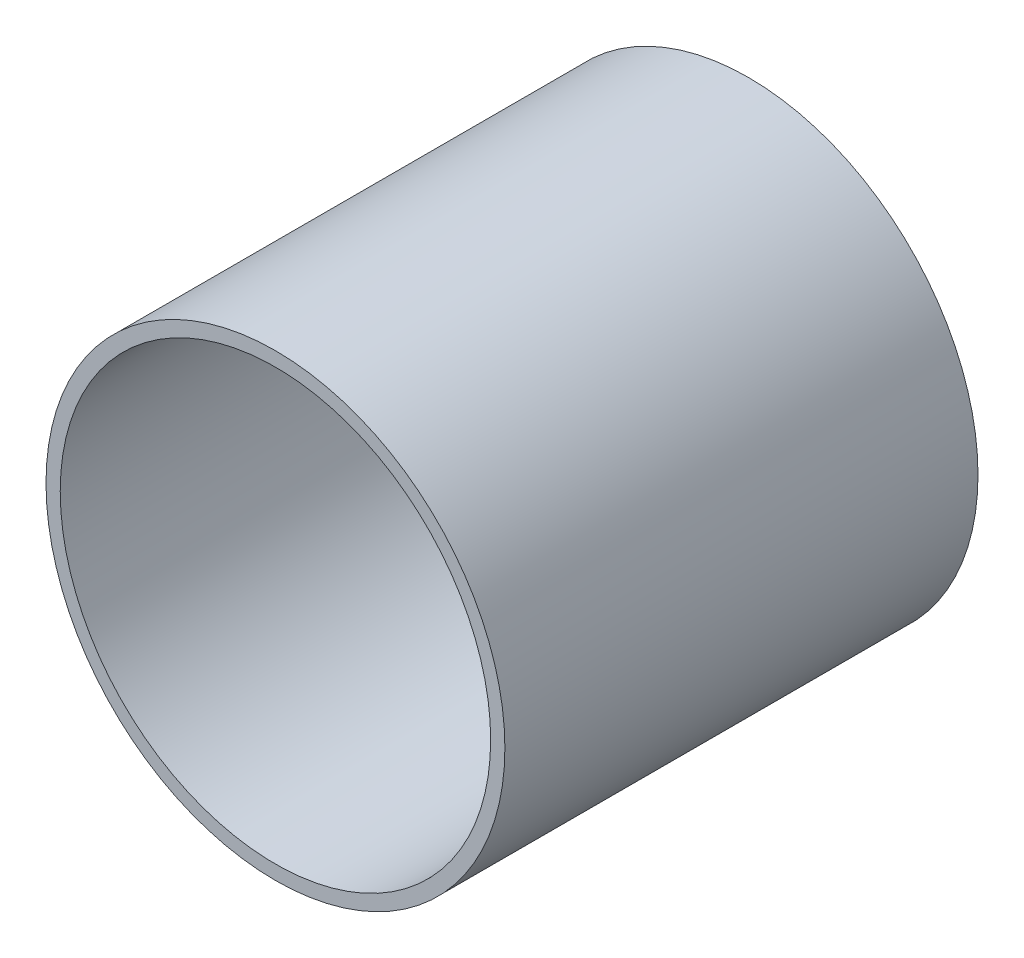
ISO-10303-21;
HEADER;
FILE_DESCRIPTION(('STEP AP214'),'2;1');
FILE_NAME('part.step','',(''),(''),'','','');
FILE_SCHEMA(('AUTOMOTIVE_DESIGN { 1 0 10303 214 1 1 1 1 }'));
ENDSEC;
DATA;
#1=APPLICATION_CONTEXT('core data for automotive mechanical design processes');
#2=APPLICATION_PROTOCOL_DEFINITION('international standard','automotive_design',2000,#1);
#3=PRODUCT_CONTEXT('',#1,'mechanical');
#4=PRODUCT('Part','Part','',(#3));
#5=PRODUCT_RELATED_PRODUCT_CATEGORY('part','',(#4));
#6=PRODUCT_DEFINITION_FORMATION('','',#4);
#7=PRODUCT_DEFINITION_CONTEXT('part definition',#1,'design');
#8=PRODUCT_DEFINITION('design','',#6,#7);
#9=PRODUCT_DEFINITION_SHAPE('','',#8);
#10=(LENGTH_UNIT() NAMED_UNIT(*) SI_UNIT(.MILLI.,.METRE.));
#11=(NAMED_UNIT(*) PLANE_ANGLE_UNIT() SI_UNIT($,.RADIAN.));
#12=(NAMED_UNIT(*) SI_UNIT($,.STERADIAN.) SOLID_ANGLE_UNIT());
#13=UNCERTAINTY_MEASURE_WITH_UNIT(LENGTH_MEASURE(1.E-05),#10,'distance_accuracy_value','');
#14=(GEOMETRIC_REPRESENTATION_CONTEXT(3) GLOBAL_UNCERTAINTY_ASSIGNED_CONTEXT((#13)) GLOBAL_UNIT_ASSIGNED_CONTEXT((#10,
#11,#12)) REPRESENTATION_CONTEXT('',''));
#15=CARTESIAN_POINT('',(0.,0.,0.));
#16=DIRECTION('',(0.,0.,1.));
#17=DIRECTION('',(1.,0.,0.));
#18=AXIS2_PLACEMENT_3D('',#15,#16,#17);
#19=CARTESIAN_POINT('',(0.,0.,1.5748));
#20=DIRECTION('',(0.,0.,-1.));
#21=DIRECTION('',(-1.,0.,0.));
#22=AXIS2_PLACEMENT_3D('',#19,#20,#21);
#23=CYLINDRICAL_SURFACE('',#22,25.4);
#24=CARTESIAN_POINT('',(0.,0.,0.));
#25=DIRECTION('',(0.,0.,1.));
#26=DIRECTION('',(1.,0.,0.));
#27=AXIS2_PLACEMENT_3D('',#24,#25,#26);
#28=CIRCLE('',#27,25.4);
#29=CARTESIAN_POINT('',(25.4,0.,0.));
#30=VERTEX_POINT('',#29);
#31=EDGE_CURVE('E46',#30,#30,#28,.T.);
#32=ORIENTED_EDGE('',*,*,#31,.T.);
#33=EDGE_LOOP('',(#32));
#34=FACE_BOUND('',#33,.T.);
#35=CARTESIAN_POINT('',(0.,0.,52.3748));
#36=DIRECTION('',(0.,0.,1.));
#37=DIRECTION('',(1.,0.,0.));
#38=AXIS2_PLACEMENT_3D('',#35,#36,#37);
#39=CIRCLE('',#38,25.4);
#40=CARTESIAN_POINT('',(25.4,0.,52.3748));
#41=VERTEX_POINT('',#40);
#42=EDGE_CURVE('E52',#41,#41,#39,.T.);
#43=ORIENTED_EDGE('',*,*,#42,.F.);
#44=EDGE_LOOP('',(#43));
#45=FACE_BOUND('',#44,.T.);
#46=ADVANCED_FACE('F39',(#34,#45),#23,.T.);
#47=CARTESIAN_POINT('',(0.,0.,0.));
#48=DIRECTION('',(0.,0.,1.));
#49=DIRECTION('',(1.,0.,0.));
#50=AXIS2_PLACEMENT_3D('',#47,#48,#49);
#51=PLANE('',#50);
#52=ORIENTED_EDGE('',*,*,#31,.F.);
#53=EDGE_LOOP('',(#52));
#54=FACE_BOUND('',#53,.T.);
#55=ADVANCED_FACE('F70',(#54),#51,.F.);
#56=CARTESIAN_POINT('',(0.,0.,52.3748));
#57=DIRECTION('',(0.,0.,1.));
#58=DIRECTION('',(1.,0.,0.));
#59=AXIS2_PLACEMENT_3D('',#56,#57,#58);
#60=PLANE('',#59);
#61=ORIENTED_EDGE('',*,*,#42,.T.);
#62=EDGE_LOOP('',(#61));
#63=FACE_BOUND('',#62,.T.);
#64=CARTESIAN_POINT('',(0.,0.,52.3748));
#65=DIRECTION('',(0.,0.,1.));
#66=DIRECTION('',(1.,0.,0.));
#67=AXIS2_PLACEMENT_3D('',#64,#65,#66);
#68=CIRCLE('',#67,23.8252);
#69=CARTESIAN_POINT('',(23.8252,0.,52.3748));
#70=VERTEX_POINT('',#69);
#71=EDGE_CURVE('E58',#70,#70,#68,.T.);
#72=ORIENTED_EDGE('',*,*,#71,.F.);
#73=EDGE_LOOP('',(#72));
#74=FACE_BOUND('',#73,.T.);
#75=ADVANCED_FACE('F68',(#63,#74),#60,.T.);
#76=CARTESIAN_POINT('',(0.,0.,52.3748));
#77=DIRECTION('',(0.,0.,-1.));
#78=DIRECTION('',(-1.,0.,0.));
#79=AXIS2_PLACEMENT_3D('',#76,#77,#78);
#80=CYLINDRICAL_SURFACE('',#79,23.8252);
#81=ORIENTED_EDGE('',*,*,#71,.T.);
#82=EDGE_LOOP('',(#81));
#83=FACE_BOUND('',#82,.T.);
#84=CARTESIAN_POINT('',(0.,0.,1.5748));
#85=DIRECTION('',(0.,0.,1.));
#86=DIRECTION('',(1.,0.,0.));
#87=AXIS2_PLACEMENT_3D('',#84,#85,#86);
#88=CIRCLE('',#87,23.8252);
#89=CARTESIAN_POINT('',(23.8252,0.,1.5748));
#90=VERTEX_POINT('',#89);
#91=EDGE_CURVE('E10',#90,#90,#88,.F.);
#92=ORIENTED_EDGE('',*,*,#91,.T.);
#93=EDGE_LOOP('',(#92));
#94=FACE_BOUND('',#93,.T.);
#95=ADVANCED_FACE('F66',(#83,#94),#80,.F.);
#96=CARTESIAN_POINT('',(0.,0.,1.5748));
#97=DIRECTION('',(0.,0.,1.));
#98=DIRECTION('',(1.,0.,0.));
#99=AXIS2_PLACEMENT_3D('',#96,#97,#98);
#100=PLANE('',#99);
#101=ORIENTED_EDGE('',*,*,#91,.F.);
#102=EDGE_LOOP('',(#101));
#103=FACE_BOUND('',#102,.T.);
#104=ADVANCED_FACE('F77',(#103),#100,.T.);
#105=CLOSED_SHELL('',(#46,#55,#75,#95,#104));
#106=MANIFOLD_SOLID_BREP('B2',#105);
#107=ADVANCED_BREP_SHAPE_REPRESENTATION('',(#18,#106),#14);
#108=SHAPE_DEFINITION_REPRESENTATION(#9,#107);
ENDSEC;
END-ISO-10303-21;
